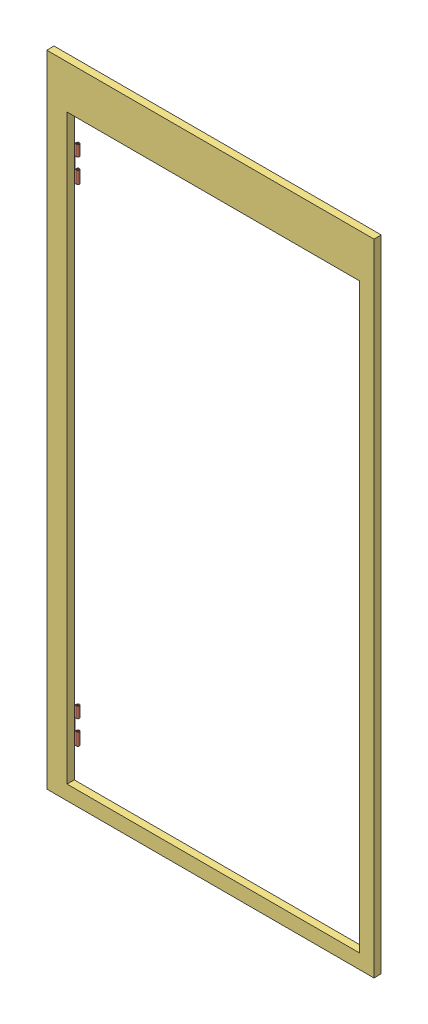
SolidWorks assembly Door-subassembly1.sldasm, configuration Default (file format 11000). Lengths in mm.
Overall size (1130 2210 75).
4 component instances, 3 part files, 0 mates.
Components (placement in the parent):
- mount1-1: mount1.sldprt [Default] at (-1030 1905 -22.5) x (0 0 1) z (-1 0 0) size (50 105 60)
- hingep1-1: hingep1.sldprt [Default] at (-942.9099 125 -8.6937) x (-1 0 0) z (0 -1 0) size (65 10 120)
- hingep1-2: hingep1.sldprt [Default] at (-942.9099 1805 -8.6937) x (-1 0 0) z (0 -1 0) size (65 10 120)
- frame-1: frame.sldprt [Default] at origin size (1130 2210 25)
